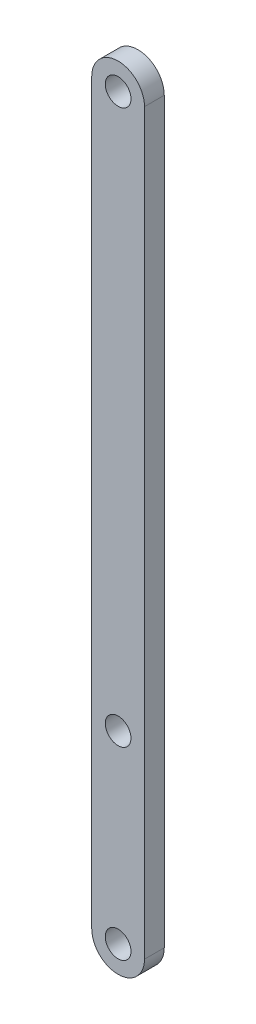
ISO-10303-21;
HEADER;
FILE_DESCRIPTION(('STEP AP214'),'2;1');
FILE_NAME('part.step','',(''),(''),'','','');
FILE_SCHEMA(('AUTOMOTIVE_DESIGN { 1 0 10303 214 1 1 1 1 }'));
ENDSEC;
DATA;
#1=APPLICATION_CONTEXT('core data for automotive mechanical design processes');
#2=APPLICATION_PROTOCOL_DEFINITION('international standard','automotive_design',2000,#1);
#3=PRODUCT_CONTEXT('',#1,'mechanical');
#4=PRODUCT('Part','Part','',(#3));
#5=PRODUCT_RELATED_PRODUCT_CATEGORY('part','',(#4));
#6=PRODUCT_DEFINITION_FORMATION('','',#4);
#7=PRODUCT_DEFINITION_CONTEXT('part definition',#1,'design');
#8=PRODUCT_DEFINITION('design','',#6,#7);
#9=PRODUCT_DEFINITION_SHAPE('','',#8);
#10=(LENGTH_UNIT() NAMED_UNIT(*) SI_UNIT(.MILLI.,.METRE.));
#11=(NAMED_UNIT(*) PLANE_ANGLE_UNIT() SI_UNIT($,.RADIAN.));
#12=(NAMED_UNIT(*) SI_UNIT($,.STERADIAN.) SOLID_ANGLE_UNIT());
#13=UNCERTAINTY_MEASURE_WITH_UNIT(LENGTH_MEASURE(1.E-05),#10,'distance_accuracy_value','');
#14=(GEOMETRIC_REPRESENTATION_CONTEXT(3) GLOBAL_UNCERTAINTY_ASSIGNED_CONTEXT((#13)) GLOBAL_UNIT_ASSIGNED_CONTEXT((#10,
#11,#12)) REPRESENTATION_CONTEXT('',''));
#15=CARTESIAN_POINT('',(0.,0.,0.));
#16=DIRECTION('',(0.,0.,1.));
#17=DIRECTION('',(1.,0.,0.));
#18=AXIS2_PLACEMENT_3D('',#15,#16,#17);
#19=CARTESIAN_POINT('',(0.,0.,3.));
#20=DIRECTION('',(0.,0.,-1.));
#21=DIRECTION('',(-1.,0.,0.));
#22=AXIS2_PLACEMENT_3D('',#19,#20,#21);
#23=CYLINDRICAL_SURFACE('',#22,4.);
#24=CARTESIAN_POINT('',(0.,0.,0.));
#25=DIRECTION('',(0.,0.,1.));
#26=DIRECTION('',(1.,0.,0.));
#27=AXIS2_PLACEMENT_3D('',#24,#25,#26);
#28=CIRCLE('',#27,4.);
#29=CARTESIAN_POINT('',(-4.,0.,0.));
#30=VERTEX_POINT('',#29);
#31=CARTESIAN_POINT('',(4.,0.,0.));
#32=VERTEX_POINT('',#31);
#33=EDGE_CURVE('E98',#30,#32,#28,.T.);
#34=ORIENTED_EDGE('',*,*,#33,.T.);
#35=DIRECTION('',(0.,0.,-1.));
#36=VECTOR('',#35,1.);
#37=CARTESIAN_POINT('',(4.,0.,3.));
#38=LINE('',#37,#36);
#39=CARTESIAN_POINT('',(4.,0.,3.));
#40=VERTEX_POINT('',#39);
#41=EDGE_CURVE('E11',#40,#32,#38,.T.);
#42=ORIENTED_EDGE('',*,*,#41,.F.);
#43=CARTESIAN_POINT('',(0.,0.,3.));
#44=DIRECTION('',(0.,0.,1.));
#45=DIRECTION('',(1.,0.,0.));
#46=AXIS2_PLACEMENT_3D('',#43,#44,#45);
#47=CIRCLE('',#46,4.);
#48=CARTESIAN_POINT('',(-4.,0.,3.));
#49=VERTEX_POINT('',#48);
#50=EDGE_CURVE('E86',#49,#40,#47,.T.);
#51=ORIENTED_EDGE('',*,*,#50,.F.);
#52=DIRECTION('',(0.,0.,-1.));
#53=VECTOR('',#52,1.);
#54=CARTESIAN_POINT('',(-4.,0.,3.));
#55=LINE('',#54,#53);
#56=EDGE_CURVE('E94',#49,#30,#55,.T.);
#57=ORIENTED_EDGE('',*,*,#56,.T.);
#58=EDGE_LOOP('',(#34,#42,#51,#57));
#59=FACE_BOUND('',#58,.T.);
#60=ADVANCED_FACE('F35',(#59),#23,.T.);
#61=CARTESIAN_POINT('',(4.,0.,3.));
#62=DIRECTION('',(-1.,0.,0.));
#63=DIRECTION('',(0.,0.,1.));
#64=AXIS2_PLACEMENT_3D('',#61,#62,#63);
#65=PLANE('',#64);
#66=DIRECTION('',(0.,1.,0.));
#67=VECTOR('',#66,1.);
#68=CARTESIAN_POINT('',(4.,0.,0.));
#69=LINE('',#68,#67);
#70=CARTESIAN_POINT('',(4.,112.,0.));
#71=VERTEX_POINT('',#70);
#72=EDGE_CURVE('E90',#32,#71,#69,.T.);
#73=ORIENTED_EDGE('',*,*,#72,.T.);
#74=DIRECTION('',(0.,0.,-1.));
#75=VECTOR('',#74,1.);
#76=CARTESIAN_POINT('',(4.,112.,3.));
#77=LINE('',#76,#75);
#78=CARTESIAN_POINT('',(4.,112.,3.));
#79=VERTEX_POINT('',#78);
#80=EDGE_CURVE('E43',#79,#71,#77,.T.);
#81=ORIENTED_EDGE('',*,*,#80,.F.);
#82=DIRECTION('',(0.,1.,0.));
#83=VECTOR('',#82,1.);
#84=CARTESIAN_POINT('',(4.,0.,3.));
#85=LINE('',#84,#83);
#86=EDGE_CURVE('E81',#40,#79,#85,.T.);
#87=ORIENTED_EDGE('',*,*,#86,.F.);
#88=ORIENTED_EDGE('',*,*,#41,.T.);
#89=EDGE_LOOP('',(#73,#81,#87,#88));
#90=FACE_BOUND('',#89,.T.);
#91=ADVANCED_FACE('F89',(#90),#65,.F.);
#92=CARTESIAN_POINT('',(0.,112.,3.));
#93=DIRECTION('',(0.,0.,-1.));
#94=DIRECTION('',(-1.,0.,0.));
#95=AXIS2_PLACEMENT_3D('',#92,#93,#94);
#96=CYLINDRICAL_SURFACE('',#95,4.);
#97=CARTESIAN_POINT('',(0.,112.,0.));
#98=DIRECTION('',(0.,0.,1.));
#99=DIRECTION('',(1.,0.,0.));
#100=AXIS2_PLACEMENT_3D('',#97,#98,#99);
#101=CIRCLE('',#100,4.);
#102=CARTESIAN_POINT('',(-4.,112.,0.));
#103=VERTEX_POINT('',#102);
#104=EDGE_CURVE('E68',#71,#103,#101,.T.);
#105=ORIENTED_EDGE('',*,*,#104,.T.);
#106=DIRECTION('',(0.,0.,-1.));
#107=VECTOR('',#106,1.);
#108=CARTESIAN_POINT('',(-4.,112.,3.));
#109=LINE('',#108,#107);
#110=CARTESIAN_POINT('',(-4.,112.,3.));
#111=VERTEX_POINT('',#110);
#112=EDGE_CURVE('E91',#111,#103,#109,.T.);
#113=ORIENTED_EDGE('',*,*,#112,.F.);
#114=CARTESIAN_POINT('',(0.,112.,3.));
#115=DIRECTION('',(0.,0.,1.));
#116=DIRECTION('',(1.,0.,0.));
#117=AXIS2_PLACEMENT_3D('',#114,#115,#116);
#118=CIRCLE('',#117,4.);
#119=EDGE_CURVE('E84',#79,#111,#118,.T.);
#120=ORIENTED_EDGE('',*,*,#119,.F.);
#121=ORIENTED_EDGE('',*,*,#80,.T.);
#122=EDGE_LOOP('',(#105,#113,#120,#121));
#123=FACE_BOUND('',#122,.T.);
#124=ADVANCED_FACE('F92',(#123),#96,.T.);
#125=CARTESIAN_POINT('',(-4.,0.,3.));
#126=DIRECTION('',(1.,0.,0.));
#127=DIRECTION('',(0.,0.,-1.));
#128=AXIS2_PLACEMENT_3D('',#125,#126,#127);
#129=PLANE('',#128);
#130=DIRECTION('',(0.,-1.,0.));
#131=VECTOR('',#130,1.);
#132=CARTESIAN_POINT('',(-4.,0.,0.));
#133=LINE('',#132,#131);
#134=EDGE_CURVE('E74',#103,#30,#133,.T.);
#135=ORIENTED_EDGE('',*,*,#134,.T.);
#136=ORIENTED_EDGE('',*,*,#56,.F.);
#137=DIRECTION('',(0.,-1.,0.));
#138=VECTOR('',#137,1.);
#139=CARTESIAN_POINT('',(-4.,0.,3.));
#140=LINE('',#139,#138);
#141=EDGE_CURVE('E51',#111,#49,#140,.T.);
#142=ORIENTED_EDGE('',*,*,#141,.F.);
#143=ORIENTED_EDGE('',*,*,#112,.T.);
#144=EDGE_LOOP('',(#135,#136,#142,#143));
#145=FACE_BOUND('',#144,.T.);
#146=ADVANCED_FACE('F106',(#145),#129,.F.);
#147=CARTESIAN_POINT('',(0.,0.,3.));
#148=DIRECTION('',(0.,0.,1.));
#149=DIRECTION('',(1.,0.,0.));
#150=AXIS2_PLACEMENT_3D('',#147,#148,#149);
#151=PLANE('',#150);
#152=CARTESIAN_POINT('',(0.,112.,3.));
#153=DIRECTION('',(0.,0.,1.));
#154=DIRECTION('',(1.,0.,0.));
#155=AXIS2_PLACEMENT_3D('',#152,#153,#154);
#156=CIRCLE('',#155,1.95);
#157=CARTESIAN_POINT('',(1.95,112.,3.));
#158=VERTEX_POINT('',#157);
#159=EDGE_CURVE('E126',#158,#158,#156,.T.);
#160=ORIENTED_EDGE('',*,*,#159,.F.);
#161=EDGE_LOOP('',(#160));
#162=FACE_BOUND('',#161,.T.);
#163=CARTESIAN_POINT('',(0.,0.,3.));
#164=DIRECTION('',(0.,0.,1.));
#165=DIRECTION('',(1.,0.,0.));
#166=AXIS2_PLACEMENT_3D('',#163,#164,#165);
#167=CIRCLE('',#166,1.95);
#168=CARTESIAN_POINT('',(1.95,0.,3.));
#169=VERTEX_POINT('',#168);
#170=EDGE_CURVE('E120',#169,#169,#167,.T.);
#171=ORIENTED_EDGE('',*,*,#170,.F.);
#172=EDGE_LOOP('',(#171));
#173=FACE_BOUND('',#172,.T.);
#174=CARTESIAN_POINT('',(0.,28.,3.));
#175=DIRECTION('',(0.,0.,1.));
#176=DIRECTION('',(1.,0.,0.));
#177=AXIS2_PLACEMENT_3D('',#174,#175,#176);
#178=CIRCLE('',#177,1.95);
#179=CARTESIAN_POINT('',(1.95000000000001,28.,3.));
#180=VERTEX_POINT('',#179);
#181=EDGE_CURVE('E114',#180,#180,#178,.T.);
#182=ORIENTED_EDGE('',*,*,#181,.F.);
#183=EDGE_LOOP('',(#182));
#184=FACE_BOUND('',#183,.T.);
#185=ORIENTED_EDGE('',*,*,#50,.T.);
#186=ORIENTED_EDGE('',*,*,#86,.T.);
#187=ORIENTED_EDGE('',*,*,#119,.T.);
#188=ORIENTED_EDGE('',*,*,#141,.T.);
#189=EDGE_LOOP('',(#185,#186,#187,#188));
#190=FACE_BOUND('',#189,.T.);
#191=ADVANCED_FACE('F82',(#162,#173,#184,#190),#151,.T.);
#192=CARTESIAN_POINT('',(0.,0.,0.));
#193=DIRECTION('',(0.,0.,1.));
#194=DIRECTION('',(1.,0.,0.));
#195=AXIS2_PLACEMENT_3D('',#192,#193,#194);
#196=PLANE('',#195);
#197=CARTESIAN_POINT('',(0.,112.,0.));
#198=DIRECTION('',(0.,0.,1.));
#199=DIRECTION('',(1.,0.,0.));
#200=AXIS2_PLACEMENT_3D('',#197,#198,#199);
#201=CIRCLE('',#200,1.95);
#202=CARTESIAN_POINT('',(1.95,112.,0.));
#203=VERTEX_POINT('',#202);
#204=EDGE_CURVE('E123',#203,#203,#201,.T.);
#205=ORIENTED_EDGE('',*,*,#204,.T.);
#206=EDGE_LOOP('',(#205));
#207=FACE_BOUND('',#206,.T.);
#208=CARTESIAN_POINT('',(0.,0.,0.));
#209=DIRECTION('',(0.,0.,1.));
#210=DIRECTION('',(1.,0.,0.));
#211=AXIS2_PLACEMENT_3D('',#208,#209,#210);
#212=CIRCLE('',#211,1.95);
#213=CARTESIAN_POINT('',(1.95,0.,0.));
#214=VERTEX_POINT('',#213);
#215=EDGE_CURVE('E117',#214,#214,#212,.T.);
#216=ORIENTED_EDGE('',*,*,#215,.T.);
#217=EDGE_LOOP('',(#216));
#218=FACE_BOUND('',#217,.T.);
#219=CARTESIAN_POINT('',(0.,28.,0.));
#220=DIRECTION('',(0.,0.,1.));
#221=DIRECTION('',(1.,0.,0.));
#222=AXIS2_PLACEMENT_3D('',#219,#220,#221);
#223=CIRCLE('',#222,1.95);
#224=CARTESIAN_POINT('',(1.95000000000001,28.,0.));
#225=VERTEX_POINT('',#224);
#226=EDGE_CURVE('E101',#225,#225,#223,.T.);
#227=ORIENTED_EDGE('',*,*,#226,.T.);
#228=EDGE_LOOP('',(#227));
#229=FACE_BOUND('',#228,.T.);
#230=ORIENTED_EDGE('',*,*,#33,.F.);
#231=ORIENTED_EDGE('',*,*,#134,.F.);
#232=ORIENTED_EDGE('',*,*,#104,.F.);
#233=ORIENTED_EDGE('',*,*,#72,.F.);
#234=EDGE_LOOP('',(#230,#231,#232,#233));
#235=FACE_BOUND('',#234,.T.);
#236=ADVANCED_FACE('F109',(#207,#218,#229,#235),#196,.F.);
#237=CARTESIAN_POINT('',(0.,28.,3.));
#238=DIRECTION('',(0.,0.,1.));
#239=DIRECTION('',(1.,0.,0.));
#240=AXIS2_PLACEMENT_3D('',#237,#238,#239);
#241=CYLINDRICAL_SURFACE('',#240,1.95);
#242=ORIENTED_EDGE('',*,*,#226,.F.);
#243=EDGE_LOOP('',(#242));
#244=FACE_BOUND('',#243,.T.);
#245=ORIENTED_EDGE('',*,*,#181,.T.);
#246=EDGE_LOOP('',(#245));
#247=FACE_BOUND('',#246,.T.);
#248=ADVANCED_FACE('F139',(#244,#247),#241,.F.);
#249=CARTESIAN_POINT('',(0.,0.,3.));
#250=DIRECTION('',(0.,0.,1.));
#251=DIRECTION('',(1.,0.,0.));
#252=AXIS2_PLACEMENT_3D('',#249,#250,#251);
#253=CYLINDRICAL_SURFACE('',#252,1.95);
#254=ORIENTED_EDGE('',*,*,#215,.F.);
#255=EDGE_LOOP('',(#254));
#256=FACE_BOUND('',#255,.T.);
#257=ORIENTED_EDGE('',*,*,#170,.T.);
#258=EDGE_LOOP('',(#257));
#259=FACE_BOUND('',#258,.T.);
#260=ADVANCED_FACE('F141',(#256,#259),#253,.F.);
#261=CARTESIAN_POINT('',(0.,112.,3.));
#262=DIRECTION('',(0.,0.,1.));
#263=DIRECTION('',(1.,0.,0.));
#264=AXIS2_PLACEMENT_3D('',#261,#262,#263);
#265=CYLINDRICAL_SURFACE('',#264,1.95);
#266=ORIENTED_EDGE('',*,*,#204,.F.);
#267=EDGE_LOOP('',(#266));
#268=FACE_BOUND('',#267,.T.);
#269=ORIENTED_EDGE('',*,*,#159,.T.);
#270=EDGE_LOOP('',(#269));
#271=FACE_BOUND('',#270,.T.);
#272=ADVANCED_FACE('F130',(#268,#271),#265,.F.);
#273=CLOSED_SHELL('',(#60,#91,#124,#146,#191,#236,#248,#260,#272));
#274=MANIFOLD_SOLID_BREP('B2',#273);
#275=ADVANCED_BREP_SHAPE_REPRESENTATION('',(#18,#274),#14);
#276=SHAPE_DEFINITION_REPRESENTATION(#9,#275);
ENDSEC;
END-ISO-10303-21;
